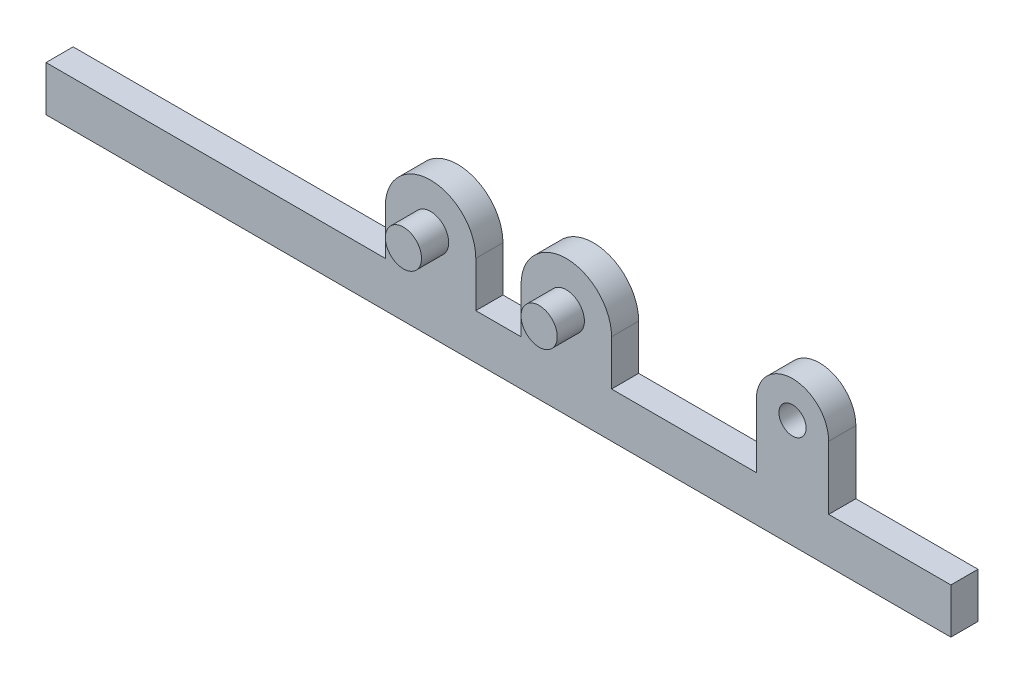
ISO-10303-21;
HEADER;
FILE_DESCRIPTION(('STEP AP214'),'2;1');
FILE_NAME('part.step','',(''),(''),'','','');
FILE_SCHEMA(('AUTOMOTIVE_DESIGN { 1 0 10303 214 1 1 1 1 }'));
ENDSEC;
DATA;
#1=APPLICATION_CONTEXT('core data for automotive mechanical design processes');
#2=APPLICATION_PROTOCOL_DEFINITION('international standard','automotive_design',2000,#1);
#3=PRODUCT_CONTEXT('',#1,'mechanical');
#4=PRODUCT('Part','Part','',(#3));
#5=PRODUCT_RELATED_PRODUCT_CATEGORY('part','',(#4));
#6=PRODUCT_DEFINITION_FORMATION('','',#4);
#7=PRODUCT_DEFINITION_CONTEXT('part definition',#1,'design');
#8=PRODUCT_DEFINITION('design','',#6,#7);
#9=PRODUCT_DEFINITION_SHAPE('','',#8);
#10=(LENGTH_UNIT() NAMED_UNIT(*) SI_UNIT(.MILLI.,.METRE.));
#11=(NAMED_UNIT(*) PLANE_ANGLE_UNIT() SI_UNIT($,.RADIAN.));
#12=(NAMED_UNIT(*) SI_UNIT($,.STERADIAN.) SOLID_ANGLE_UNIT());
#13=UNCERTAINTY_MEASURE_WITH_UNIT(LENGTH_MEASURE(1.E-05),#10,'distance_accuracy_value','');
#14=(GEOMETRIC_REPRESENTATION_CONTEXT(3) GLOBAL_UNCERTAINTY_ASSIGNED_CONTEXT((#13)) GLOBAL_UNIT_ASSIGNED_CONTEXT((#10,
#11,#12)) REPRESENTATION_CONTEXT('',''));
#15=CARTESIAN_POINT('',(0.,0.,0.));
#16=DIRECTION('',(0.,0.,1.));
#17=DIRECTION('',(1.,0.,0.));
#18=AXIS2_PLACEMENT_3D('',#15,#16,#17);
#19=CARTESIAN_POINT('',(1000.,0.,30.));
#20=DIRECTION('',(0.,-1.,0.));
#21=DIRECTION('',(0.,0.,-1.));
#22=AXIS2_PLACEMENT_3D('',#19,#20,#21);
#23=PLANE('',#22);
#24=DIRECTION('',(1.,0.,0.));
#25=VECTOR('',#24,1.);
#26=CARTESIAN_POINT('',(1000.,0.,30.));
#27=LINE('',#26,#25);
#28=CARTESIAN_POINT('',(625.,0.,30.));
#29=VERTEX_POINT('',#28);
#30=CARTESIAN_POINT('',(785.,0.,30.));
#31=VERTEX_POINT('',#30);
#32=EDGE_CURVE('E50',#29,#31,#27,.T.);
#33=ORIENTED_EDGE('',*,*,#32,.T.);
#34=DIRECTION('',(0.,0.,1.));
#35=VECTOR('',#34,1.);
#36=CARTESIAN_POINT('',(785.,0.,0.));
#37=LINE('',#36,#35);
#38=CARTESIAN_POINT('',(785.,0.,0.));
#39=VERTEX_POINT('',#38);
#40=EDGE_CURVE('E168',#39,#31,#37,.T.);
#41=ORIENTED_EDGE('',*,*,#40,.F.);
#42=DIRECTION('',(1.,0.,0.));
#43=VECTOR('',#42,1.);
#44=CARTESIAN_POINT('',(1000.,0.,0.));
#45=LINE('',#44,#43);
#46=CARTESIAN_POINT('',(625.,0.,0.));
#47=VERTEX_POINT('',#46);
#48=EDGE_CURVE('E207',#47,#39,#45,.T.);
#49=ORIENTED_EDGE('',*,*,#48,.F.);
#50=DIRECTION('',(0.,0.,-1.));
#51=VECTOR('',#50,1.);
#52=CARTESIAN_POINT('',(625.,0.,30.));
#53=LINE('',#52,#51);
#54=EDGE_CURVE('E221',#29,#47,#53,.T.);
#55=ORIENTED_EDGE('',*,*,#54,.F.);
#56=EDGE_LOOP('',(#33,#41,#49,#55));
#57=FACE_BOUND('',#56,.T.);
#58=ADVANCED_FACE('F35',(#57),#23,.F.);
#59=CARTESIAN_POINT('',(425.,50.,30.));
#60=DIRECTION('',(0.,0.,-1.));
#61=DIRECTION('',(-1.,0.,0.));
#62=AXIS2_PLACEMENT_3D('',#59,#60,#61);
#63=PLANE('',#62);
#64=CARTESIAN_POINT('',(825.,70.,30.));
#65=DIRECTION('',(0.,0.,1.));
#66=DIRECTION('',(1.,0.,0.));
#67=AXIS2_PLACEMENT_3D('',#64,#65,#66);
#68=CIRCLE('',#67,15.);
#69=CARTESIAN_POINT('',(840.,70.,30.));
#70=VERTEX_POINT('',#69);
#71=EDGE_CURVE('E437',#70,#70,#68,.T.);
#72=ORIENTED_EDGE('',*,*,#71,.F.);
#73=EDGE_LOOP('',(#72));
#74=FACE_BOUND('',#73,.T.);
#75=DIRECTION('',(0.,-1.,0.));
#76=VECTOR('',#75,1.);
#77=CARTESIAN_POINT('',(0.,0.,30.));
#78=LINE('',#77,#76);
#79=CARTESIAN_POINT('',(0.,0.,30.));
#80=VERTEX_POINT('',#79);
#81=CARTESIAN_POINT('',(0.,-50.,30.));
#82=VERTEX_POINT('',#81);
#83=EDGE_CURVE('E257',#80,#82,#78,.T.);
#84=ORIENTED_EDGE('',*,*,#83,.T.);
#85=DIRECTION('',(1.,0.,0.));
#86=VECTOR('',#85,1.);
#87=CARTESIAN_POINT('',(0.,-50.,30.));
#88=LINE('',#87,#86);
#89=CARTESIAN_POINT('',(1000.,-50.,30.));
#90=VERTEX_POINT('',#89);
#91=EDGE_CURVE('E259',#82,#90,#88,.T.);
#92=ORIENTED_EDGE('',*,*,#91,.T.);
#93=DIRECTION('',(0.,-1.,0.));
#94=VECTOR('',#93,1.);
#95=CARTESIAN_POINT('',(1000.,0.,30.));
#96=LINE('',#95,#94);
#97=CARTESIAN_POINT('',(1000.,0.,30.));
#98=VERTEX_POINT('',#97);
#99=EDGE_CURVE('E158',#98,#90,#96,.T.);
#100=ORIENTED_EDGE('',*,*,#99,.F.);
#101=CARTESIAN_POINT('',(865.,0.,30.));
#102=VERTEX_POINT('',#101);
#103=EDGE_CURVE('E149',#102,#98,#27,.T.);
#104=ORIENTED_EDGE('',*,*,#103,.F.);
#105=DIRECTION('',(0.,1.,0.));
#106=VECTOR('',#105,1.);
#107=CARTESIAN_POINT('',(865.,0.,30.));
#108=LINE('',#107,#106);
#109=CARTESIAN_POINT('',(865.,70.,30.));
#110=VERTEX_POINT('',#109);
#111=EDGE_CURVE('E155',#102,#110,#108,.T.);
#112=ORIENTED_EDGE('',*,*,#111,.T.);
#113=CARTESIAN_POINT('',(825.,70.,30.));
#114=DIRECTION('',(0.,0.,1.));
#115=DIRECTION('',(-1.,0.,0.));
#116=AXIS2_PLACEMENT_3D('',#113,#114,#115);
#117=CIRCLE('',#116,40.);
#118=CARTESIAN_POINT('',(785.,70.,30.));
#119=VERTEX_POINT('',#118);
#120=EDGE_CURVE('E171',#110,#119,#117,.T.);
#121=ORIENTED_EDGE('',*,*,#120,.T.);
#122=DIRECTION('',(0.,-1.,0.));
#123=VECTOR('',#122,1.);
#124=CARTESIAN_POINT('',(785.,0.,30.));
#125=LINE('',#124,#123);
#126=EDGE_CURVE('E172',#119,#31,#125,.T.);
#127=ORIENTED_EDGE('',*,*,#126,.T.);
#128=ORIENTED_EDGE('',*,*,#32,.F.);
#129=DIRECTION('',(0.,-1.,0.));
#130=VECTOR('',#129,1.);
#131=CARTESIAN_POINT('',(625.,0.,30.));
#132=LINE('',#131,#130);
#133=CARTESIAN_POINT('',(625.,50.,30.));
#134=VERTEX_POINT('',#133);
#135=EDGE_CURVE('E160',#134,#29,#132,.T.);
#136=ORIENTED_EDGE('',*,*,#135,.F.);
#137=CARTESIAN_POINT('',(575.,50.,30.));
#138=DIRECTION('',(0.,0.,-1.));
#139=DIRECTION('',(1.,0.,0.));
#140=AXIS2_PLACEMENT_3D('',#137,#138,#139);
#141=CIRCLE('',#140,50.);
#142=CARTESIAN_POINT('',(525.,50.,30.));
#143=VERTEX_POINT('',#142);
#144=EDGE_CURVE('E214',#143,#134,#141,.T.);
#145=ORIENTED_EDGE('',*,*,#144,.F.);
#146=DIRECTION('',(0.,1.,0.));
#147=VECTOR('',#146,1.);
#148=CARTESIAN_POINT('',(525.,0.,30.));
#149=LINE('',#148,#147);
#150=CARTESIAN_POINT('',(525.,0.,30.));
#151=VERTEX_POINT('',#150);
#152=EDGE_CURVE('E211',#151,#143,#149,.T.);
#153=ORIENTED_EDGE('',*,*,#152,.F.);
#154=DIRECTION('',(-1.,0.,0.));
#155=VECTOR('',#154,1.);
#156=CARTESIAN_POINT('',(475.,0.,30.));
#157=LINE('',#156,#155);
#158=CARTESIAN_POINT('',(475.,0.,30.));
#159=VERTEX_POINT('',#158);
#160=EDGE_CURVE('E261',#151,#159,#157,.T.);
#161=ORIENTED_EDGE('',*,*,#160,.T.);
#162=DIRECTION('',(0.,1.,0.));
#163=VECTOR('',#162,1.);
#164=CARTESIAN_POINT('',(475.,0.,30.));
#165=LINE('',#164,#163);
#166=CARTESIAN_POINT('',(475.,50.,30.));
#167=VERTEX_POINT('',#166);
#168=EDGE_CURVE('E263',#159,#167,#165,.T.);
#169=ORIENTED_EDGE('',*,*,#168,.T.);
#170=CARTESIAN_POINT('',(425.,50.,30.));
#171=DIRECTION('',(0.,0.,1.));
#172=DIRECTION('',(-1.,0.,0.));
#173=AXIS2_PLACEMENT_3D('',#170,#171,#172);
#174=CIRCLE('',#173,50.);
#175=CARTESIAN_POINT('',(375.,50.,30.));
#176=VERTEX_POINT('',#175);
#177=EDGE_CURVE('E265',#167,#176,#174,.T.);
#178=ORIENTED_EDGE('',*,*,#177,.T.);
#179=DIRECTION('',(0.,-1.,0.));
#180=VECTOR('',#179,1.);
#181=CARTESIAN_POINT('',(375.,0.,30.));
#182=LINE('',#181,#180);
#183=CARTESIAN_POINT('',(375.,0.,30.));
#184=VERTEX_POINT('',#183);
#185=EDGE_CURVE('E267',#176,#184,#182,.T.);
#186=ORIENTED_EDGE('',*,*,#185,.T.);
#187=DIRECTION('',(-1.,0.,0.));
#188=VECTOR('',#187,1.);
#189=CARTESIAN_POINT('',(0.,0.,30.));
#190=LINE('',#189,#188);
#191=EDGE_CURVE('E269',#184,#80,#190,.T.);
#192=ORIENTED_EDGE('',*,*,#191,.T.);
#193=EDGE_LOOP('',(#84,#92,#100,#104,#112,#121,#127,#128,#136,#145,#153,#161,#169,#178,#186,#192));
#194=FACE_BOUND('',#193,.T.);
#195=CARTESIAN_POINT('',(425.,50.,30.));
#196=DIRECTION('',(0.,0.,-1.));
#197=DIRECTION('',(-1.,0.,0.));
#198=AXIS2_PLACEMENT_3D('',#195,#196,#197);
#199=CIRCLE('',#198,20.);
#200=CARTESIAN_POINT('',(405.,50.,30.));
#201=VERTEX_POINT('',#200);
#202=EDGE_CURVE('E11',#201,#201,#199,.F.);
#203=ORIENTED_EDGE('',*,*,#202,.F.);
#204=EDGE_LOOP('',(#203));
#205=FACE_BOUND('',#204,.T.);
#206=CARTESIAN_POINT('',(575.,50.,30.));
#207=DIRECTION('',(0.,0.,1.));
#208=DIRECTION('',(1.,0.,0.));
#209=AXIS2_PLACEMENT_3D('',#206,#207,#208);
#210=CIRCLE('',#209,20.);
#211=CARTESIAN_POINT('',(595.,50.,30.));
#212=VERTEX_POINT('',#211);
#213=EDGE_CURVE('E236',#212,#212,#210,.F.);
#214=ORIENTED_EDGE('',*,*,#213,.T.);
#215=EDGE_LOOP('',(#214));
#216=FACE_BOUND('',#215,.T.);
#217=ADVANCED_FACE('F151',(#74,#194,#205,#216),#63,.F.);
#218=CARTESIAN_POINT('',(0.,0.,30.));
#219=DIRECTION('',(1.,0.,0.));
#220=DIRECTION('',(0.,0.,-1.));
#221=AXIS2_PLACEMENT_3D('',#218,#219,#220);
#222=PLANE('',#221);
#223=DIRECTION('',(0.,-1.,0.));
#224=VECTOR('',#223,1.);
#225=CARTESIAN_POINT('',(0.,0.,0.));
#226=LINE('',#225,#224);
#227=CARTESIAN_POINT('',(0.,0.,0.));
#228=VERTEX_POINT('',#227);
#229=CARTESIAN_POINT('',(0.,-50.,0.));
#230=VERTEX_POINT('',#229);
#231=EDGE_CURVE('E242',#228,#230,#226,.T.);
#232=ORIENTED_EDGE('',*,*,#231,.T.);
#233=DIRECTION('',(0.,0.,-1.));
#234=VECTOR('',#233,1.);
#235=CARTESIAN_POINT('',(0.,-50.,30.));
#236=LINE('',#235,#234);
#237=EDGE_CURVE('E43',#82,#230,#236,.T.);
#238=ORIENTED_EDGE('',*,*,#237,.F.);
#239=ORIENTED_EDGE('',*,*,#83,.F.);
#240=DIRECTION('',(0.,0.,-1.));
#241=VECTOR('',#240,1.);
#242=CARTESIAN_POINT('',(0.,0.,30.));
#243=LINE('',#242,#241);
#244=EDGE_CURVE('E271',#80,#228,#243,.T.);
#245=ORIENTED_EDGE('',*,*,#244,.T.);
#246=EDGE_LOOP('',(#232,#238,#239,#245));
#247=FACE_BOUND('',#246,.T.);
#248=ADVANCED_FACE('F37',(#247),#222,.F.);
#249=CARTESIAN_POINT('',(0.,-50.,30.));
#250=DIRECTION('',(0.,1.,0.));
#251=DIRECTION('',(-1.,0.,0.));
#252=AXIS2_PLACEMENT_3D('',#249,#250,#251);
#253=PLANE('',#252);
#254=DIRECTION('',(1.,0.,0.));
#255=VECTOR('',#254,1.);
#256=CARTESIAN_POINT('',(0.,-50.,0.));
#257=LINE('',#256,#255);
#258=CARTESIAN_POINT('',(1000.,-50.,0.));
#259=VERTEX_POINT('',#258);
#260=EDGE_CURVE('E245',#230,#259,#257,.T.);
#261=ORIENTED_EDGE('',*,*,#260,.T.);
#262=DIRECTION('',(0.,0.,-1.));
#263=VECTOR('',#262,1.);
#264=CARTESIAN_POINT('',(1000.,-50.,30.));
#265=LINE('',#264,#263);
#266=EDGE_CURVE('E233',#90,#259,#265,.T.);
#267=ORIENTED_EDGE('',*,*,#266,.F.);
#268=ORIENTED_EDGE('',*,*,#91,.F.);
#269=ORIENTED_EDGE('',*,*,#237,.T.);
#270=EDGE_LOOP('',(#261,#267,#268,#269));
#271=FACE_BOUND('',#270,.T.);
#272=ADVANCED_FACE('F288',(#271),#253,.F.);
#273=CARTESIAN_POINT('',(475.,0.,30.));
#274=DIRECTION('',(0.,-1.,0.));
#275=DIRECTION('',(0.,0.,-1.));
#276=AXIS2_PLACEMENT_3D('',#273,#274,#275);
#277=PLANE('',#276);
#278=DIRECTION('',(-1.,0.,0.));
#279=VECTOR('',#278,1.);
#280=CARTESIAN_POINT('',(475.,0.,0.));
#281=LINE('',#280,#279);
#282=CARTESIAN_POINT('',(525.,0.,0.));
#283=VERTEX_POINT('',#282);
#284=CARTESIAN_POINT('',(475.,0.,0.));
#285=VERTEX_POINT('',#284);
#286=EDGE_CURVE('E247',#283,#285,#281,.T.);
#287=ORIENTED_EDGE('',*,*,#286,.T.);
#288=DIRECTION('',(0.,0.,-1.));
#289=VECTOR('',#288,1.);
#290=CARTESIAN_POINT('',(475.,0.,30.));
#291=LINE('',#290,#289);
#292=EDGE_CURVE('E283',#159,#285,#291,.T.);
#293=ORIENTED_EDGE('',*,*,#292,.F.);
#294=ORIENTED_EDGE('',*,*,#160,.F.);
#295=DIRECTION('',(0.,0.,-1.));
#296=VECTOR('',#295,1.);
#297=CARTESIAN_POINT('',(525.,0.,30.));
#298=LINE('',#297,#296);
#299=EDGE_CURVE('E230',#151,#283,#298,.T.);
#300=ORIENTED_EDGE('',*,*,#299,.T.);
#301=EDGE_LOOP('',(#287,#293,#294,#300));
#302=FACE_BOUND('',#301,.T.);
#303=ADVANCED_FACE('F346',(#302),#277,.F.);
#304=CARTESIAN_POINT('',(475.,0.,30.));
#305=DIRECTION('',(-1.,0.,0.));
#306=DIRECTION('',(0.,0.,1.));
#307=AXIS2_PLACEMENT_3D('',#304,#305,#306);
#308=PLANE('',#307);
#309=DIRECTION('',(0.,1.,0.));
#310=VECTOR('',#309,1.);
#311=CARTESIAN_POINT('',(475.,0.,0.));
#312=LINE('',#311,#310);
#313=CARTESIAN_POINT('',(475.,50.,0.));
#314=VERTEX_POINT('',#313);
#315=EDGE_CURVE('E249',#285,#314,#312,.T.);
#316=ORIENTED_EDGE('',*,*,#315,.T.);
#317=DIRECTION('',(0.,0.,-1.));
#318=VECTOR('',#317,1.);
#319=CARTESIAN_POINT('',(475.,50.,30.));
#320=LINE('',#319,#318);
#321=EDGE_CURVE('E280',#167,#314,#320,.T.);
#322=ORIENTED_EDGE('',*,*,#321,.F.);
#323=ORIENTED_EDGE('',*,*,#168,.F.);
#324=ORIENTED_EDGE('',*,*,#292,.T.);
#325=EDGE_LOOP('',(#316,#322,#323,#324));
#326=FACE_BOUND('',#325,.T.);
#327=ADVANCED_FACE('F467',(#326),#308,.F.);
#328=CARTESIAN_POINT('',(425.,50.,30.));
#329=DIRECTION('',(0.,0.,-1.));
#330=DIRECTION('',(-1.,0.,0.));
#331=AXIS2_PLACEMENT_3D('',#328,#329,#330);
#332=CYLINDRICAL_SURFACE('',#331,50.);
#333=CARTESIAN_POINT('',(425.,50.,0.));
#334=DIRECTION('',(0.,0.,1.));
#335=DIRECTION('',(-1.,0.,0.));
#336=AXIS2_PLACEMENT_3D('',#333,#334,#335);
#337=CIRCLE('',#336,50.);
#338=CARTESIAN_POINT('',(375.,50.,0.));
#339=VERTEX_POINT('',#338);
#340=EDGE_CURVE('E251',#314,#339,#337,.T.);
#341=ORIENTED_EDGE('',*,*,#340,.T.);
#342=DIRECTION('',(0.,0.,-1.));
#343=VECTOR('',#342,1.);
#344=CARTESIAN_POINT('',(375.,50.,30.));
#345=LINE('',#344,#343);
#346=EDGE_CURVE('E277',#176,#339,#345,.T.);
#347=ORIENTED_EDGE('',*,*,#346,.F.);
#348=ORIENTED_EDGE('',*,*,#177,.F.);
#349=ORIENTED_EDGE('',*,*,#321,.T.);
#350=EDGE_LOOP('',(#341,#347,#348,#349));
#351=FACE_BOUND('',#350,.T.);
#352=ADVANCED_FACE('F507',(#351),#332,.T.);
#353=CARTESIAN_POINT('',(375.,0.,30.));
#354=DIRECTION('',(1.,0.,0.));
#355=DIRECTION('',(0.,0.,-1.));
#356=AXIS2_PLACEMENT_3D('',#353,#354,#355);
#357=PLANE('',#356);
#358=DIRECTION('',(0.,-1.,0.));
#359=VECTOR('',#358,1.);
#360=CARTESIAN_POINT('',(375.,0.,0.));
#361=LINE('',#360,#359);
#362=CARTESIAN_POINT('',(375.,0.,0.));
#363=VERTEX_POINT('',#362);
#364=EDGE_CURVE('E253',#339,#363,#361,.T.);
#365=ORIENTED_EDGE('',*,*,#364,.T.);
#366=DIRECTION('',(0.,0.,-1.));
#367=VECTOR('',#366,1.);
#368=CARTESIAN_POINT('',(375.,0.,30.));
#369=LINE('',#368,#367);
#370=EDGE_CURVE('E274',#184,#363,#369,.T.);
#371=ORIENTED_EDGE('',*,*,#370,.F.);
#372=ORIENTED_EDGE('',*,*,#185,.F.);
#373=ORIENTED_EDGE('',*,*,#346,.T.);
#374=EDGE_LOOP('',(#365,#371,#372,#373));
#375=FACE_BOUND('',#374,.T.);
#376=ADVANCED_FACE('F514',(#375),#357,.F.);
#377=CARTESIAN_POINT('',(0.,0.,30.));
#378=DIRECTION('',(0.,-1.,0.));
#379=DIRECTION('',(0.,0.,-1.));
#380=AXIS2_PLACEMENT_3D('',#377,#378,#379);
#381=PLANE('',#380);
#382=DIRECTION('',(-1.,0.,0.));
#383=VECTOR('',#382,1.);
#384=CARTESIAN_POINT('',(0.,0.,0.));
#385=LINE('',#384,#383);
#386=EDGE_CURVE('E255',#363,#228,#385,.T.);
#387=ORIENTED_EDGE('',*,*,#386,.T.);
#388=ORIENTED_EDGE('',*,*,#244,.F.);
#389=ORIENTED_EDGE('',*,*,#191,.F.);
#390=ORIENTED_EDGE('',*,*,#370,.T.);
#391=EDGE_LOOP('',(#387,#388,#389,#390));
#392=FACE_BOUND('',#391,.T.);
#393=ADVANCED_FACE('F414',(#392),#381,.F.);
#394=CARTESIAN_POINT('',(425.,50.,0.));
#395=DIRECTION('',(0.,0.,-1.));
#396=DIRECTION('',(-1.,0.,0.));
#397=AXIS2_PLACEMENT_3D('',#394,#395,#396);
#398=PLANE('',#397);
#399=CARTESIAN_POINT('',(825.,70.,0.));
#400=DIRECTION('',(0.,0.,1.));
#401=DIRECTION('',(1.,0.,0.));
#402=AXIS2_PLACEMENT_3D('',#399,#400,#401);
#403=CIRCLE('',#402,15.);
#404=CARTESIAN_POINT('',(840.,70.,0.));
#405=VERTEX_POINT('',#404);
#406=EDGE_CURVE('E177',#405,#405,#403,.T.);
#407=ORIENTED_EDGE('',*,*,#406,.T.);
#408=EDGE_LOOP('',(#407));
#409=FACE_BOUND('',#408,.T.);
#410=ORIENTED_EDGE('',*,*,#231,.F.);
#411=ORIENTED_EDGE('',*,*,#386,.F.);
#412=ORIENTED_EDGE('',*,*,#364,.F.);
#413=ORIENTED_EDGE('',*,*,#340,.F.);
#414=ORIENTED_EDGE('',*,*,#315,.F.);
#415=ORIENTED_EDGE('',*,*,#286,.F.);
#416=DIRECTION('',(0.,1.,0.));
#417=VECTOR('',#416,1.);
#418=CARTESIAN_POINT('',(525.,0.,0.));
#419=LINE('',#418,#417);
#420=CARTESIAN_POINT('',(525.,50.,0.));
#421=VERTEX_POINT('',#420);
#422=EDGE_CURVE('E198',#283,#421,#419,.T.);
#423=ORIENTED_EDGE('',*,*,#422,.T.);
#424=CARTESIAN_POINT('',(575.,50.,0.));
#425=DIRECTION('',(0.,0.,-1.));
#426=DIRECTION('',(1.,0.,0.));
#427=AXIS2_PLACEMENT_3D('',#424,#425,#426);
#428=CIRCLE('',#427,50.);
#429=CARTESIAN_POINT('',(625.,50.,0.));
#430=VERTEX_POINT('',#429);
#431=EDGE_CURVE('E201',#421,#430,#428,.T.);
#432=ORIENTED_EDGE('',*,*,#431,.T.);
#433=DIRECTION('',(0.,-1.,0.));
#434=VECTOR('',#433,1.);
#435=CARTESIAN_POINT('',(625.,0.,0.));
#436=LINE('',#435,#434);
#437=EDGE_CURVE('E204',#430,#47,#436,.T.);
#438=ORIENTED_EDGE('',*,*,#437,.T.);
#439=ORIENTED_EDGE('',*,*,#48,.T.);
#440=DIRECTION('',(0.,-1.,0.));
#441=VECTOR('',#440,1.);
#442=CARTESIAN_POINT('',(785.,0.,0.));
#443=LINE('',#442,#441);
#444=CARTESIAN_POINT('',(785.,70.,0.));
#445=VERTEX_POINT('',#444);
#446=EDGE_CURVE('E174',#445,#39,#443,.T.);
#447=ORIENTED_EDGE('',*,*,#446,.F.);
#448=CARTESIAN_POINT('',(825.,70.,0.));
#449=DIRECTION('',(0.,0.,1.));
#450=DIRECTION('',(-1.,0.,0.));
#451=AXIS2_PLACEMENT_3D('',#448,#449,#450);
#452=CIRCLE('',#451,40.);
#453=CARTESIAN_POINT('',(865.,70.,0.));
#454=VERTEX_POINT('',#453);
#455=EDGE_CURVE('E185',#454,#445,#452,.T.);
#456=ORIENTED_EDGE('',*,*,#455,.F.);
#457=DIRECTION('',(0.,1.,0.));
#458=VECTOR('',#457,1.);
#459=CARTESIAN_POINT('',(865.,0.,0.));
#460=LINE('',#459,#458);
#461=CARTESIAN_POINT('',(865.,0.,0.));
#462=VERTEX_POINT('',#461);
#463=EDGE_CURVE('E183',#462,#454,#460,.T.);
#464=ORIENTED_EDGE('',*,*,#463,.F.);
#465=CARTESIAN_POINT('',(1000.,0.,0.));
#466=VERTEX_POINT('',#465);
#467=EDGE_CURVE('E58',#462,#466,#45,.T.);
#468=ORIENTED_EDGE('',*,*,#467,.T.);
#469=DIRECTION('',(0.,-1.,0.));
#470=VECTOR('',#469,1.);
#471=CARTESIAN_POINT('',(1000.,0.,0.));
#472=LINE('',#471,#470);
#473=EDGE_CURVE('E195',#466,#259,#472,.T.);
#474=ORIENTED_EDGE('',*,*,#473,.T.);
#475=ORIENTED_EDGE('',*,*,#260,.F.);
#476=EDGE_LOOP('',(#410,#411,#412,#413,#414,#415,#423,#432,#438,#439,#447,#456,#464,#468,#474,#475));
#477=FACE_BOUND('',#476,.T.);
#478=ADVANCED_FACE('F296',(#409,#477),#398,.T.);
#479=CARTESIAN_POINT('',(425.,50.,60.));
#480=DIRECTION('',(0.,0.,-1.));
#481=DIRECTION('',(-1.,0.,0.));
#482=AXIS2_PLACEMENT_3D('',#479,#480,#481);
#483=CYLINDRICAL_SURFACE('',#482,20.);
#484=CARTESIAN_POINT('',(425.,50.,60.));
#485=DIRECTION('',(0.,0.,1.));
#486=DIRECTION('',(1.,0.,0.));
#487=AXIS2_PLACEMENT_3D('',#484,#485,#486);
#488=CIRCLE('',#487,20.);
#489=CARTESIAN_POINT('',(445.,50.,60.));
#490=VERTEX_POINT('',#489);
#491=EDGE_CURVE('E239',#490,#490,#488,.T.);
#492=ORIENTED_EDGE('',*,*,#491,.F.);
#493=EDGE_LOOP('',(#492));
#494=FACE_BOUND('',#493,.T.);
#495=ORIENTED_EDGE('',*,*,#202,.T.);
#496=EDGE_LOOP('',(#495));
#497=FACE_BOUND('',#496,.T.);
#498=ADVANCED_FACE('F312',(#494,#497),#483,.T.);
#499=CARTESIAN_POINT('',(425.,50.,60.));
#500=DIRECTION('',(0.,0.,1.));
#501=DIRECTION('',(1.,0.,0.));
#502=AXIS2_PLACEMENT_3D('',#499,#500,#501);
#503=PLANE('',#502);
#504=ORIENTED_EDGE('',*,*,#491,.T.);
#505=EDGE_LOOP('',(#504));
#506=FACE_BOUND('',#505,.T.);
#507=ADVANCED_FACE('F303',(#506),#503,.T.);
#508=CARTESIAN_POINT('',(1000.,0.,30.));
#509=DIRECTION('',(-1.,0.,0.));
#510=DIRECTION('',(0.,0.,-1.));
#511=AXIS2_PLACEMENT_3D('',#508,#509,#510);
#512=PLANE('',#511);
#513=ORIENTED_EDGE('',*,*,#473,.F.);
#514=DIRECTION('',(0.,0.,-1.));
#515=VECTOR('',#514,1.);
#516=CARTESIAN_POINT('',(1000.,0.,30.));
#517=LINE('',#516,#515);
#518=EDGE_CURVE('E219',#98,#466,#517,.T.);
#519=ORIENTED_EDGE('',*,*,#518,.F.);
#520=ORIENTED_EDGE('',*,*,#99,.T.);
#521=ORIENTED_EDGE('',*,*,#266,.T.);
#522=EDGE_LOOP('',(#513,#519,#520,#521));
#523=FACE_BOUND('',#522,.T.);
#524=ADVANCED_FACE('F300',(#523),#512,.F.);
#525=CARTESIAN_POINT('',(525.,0.,30.));
#526=DIRECTION('',(1.,0.,0.));
#527=DIRECTION('',(0.,0.,1.));
#528=AXIS2_PLACEMENT_3D('',#525,#526,#527);
#529=PLANE('',#528);
#530=ORIENTED_EDGE('',*,*,#422,.F.);
#531=ORIENTED_EDGE('',*,*,#299,.F.);
#532=ORIENTED_EDGE('',*,*,#152,.T.);
#533=DIRECTION('',(0.,0.,-1.));
#534=VECTOR('',#533,1.);
#535=CARTESIAN_POINT('',(525.,50.,30.));
#536=LINE('',#535,#534);
#537=EDGE_CURVE('E227',#143,#421,#536,.T.);
#538=ORIENTED_EDGE('',*,*,#537,.T.);
#539=EDGE_LOOP('',(#530,#531,#532,#538));
#540=FACE_BOUND('',#539,.T.);
#541=ADVANCED_FACE('F302',(#540),#529,.F.);
#542=CARTESIAN_POINT('',(575.,50.,30.));
#543=DIRECTION('',(0.,0.,-1.));
#544=DIRECTION('',(1.,0.,0.));
#545=AXIS2_PLACEMENT_3D('',#542,#543,#544);
#546=CYLINDRICAL_SURFACE('',#545,50.);
#547=ORIENTED_EDGE('',*,*,#431,.F.);
#548=ORIENTED_EDGE('',*,*,#537,.F.);
#549=ORIENTED_EDGE('',*,*,#144,.T.);
#550=DIRECTION('',(0.,0.,-1.));
#551=VECTOR('',#550,1.);
#552=CARTESIAN_POINT('',(625.,50.,30.));
#553=LINE('',#552,#551);
#554=EDGE_CURVE('E224',#134,#430,#553,.T.);
#555=ORIENTED_EDGE('',*,*,#554,.T.);
#556=EDGE_LOOP('',(#547,#548,#549,#555));
#557=FACE_BOUND('',#556,.T.);
#558=ADVANCED_FACE('F309',(#557),#546,.T.);
#559=CARTESIAN_POINT('',(625.,0.,30.));
#560=DIRECTION('',(-1.,0.,0.));
#561=DIRECTION('',(0.,0.,-1.));
#562=AXIS2_PLACEMENT_3D('',#559,#560,#561);
#563=PLANE('',#562);
#564=ORIENTED_EDGE('',*,*,#437,.F.);
#565=ORIENTED_EDGE('',*,*,#554,.F.);
#566=ORIENTED_EDGE('',*,*,#135,.T.);
#567=ORIENTED_EDGE('',*,*,#54,.T.);
#568=EDGE_LOOP('',(#564,#565,#566,#567));
#569=FACE_BOUND('',#568,.T.);
#570=ADVANCED_FACE('F326',(#569),#563,.F.);
#571=ORIENTED_EDGE('',*,*,#467,.F.);
#572=DIRECTION('',(0.,0.,1.));
#573=VECTOR('',#572,1.);
#574=CARTESIAN_POINT('',(865.,0.,0.));
#575=LINE('',#574,#573);
#576=EDGE_CURVE('E162',#462,#102,#575,.T.);
#577=ORIENTED_EDGE('',*,*,#576,.T.);
#578=ORIENTED_EDGE('',*,*,#103,.T.);
#579=ORIENTED_EDGE('',*,*,#518,.T.);
#580=EDGE_LOOP('',(#571,#577,#578,#579));
#581=FACE_BOUND('',#580,.T.);
#582=ADVANCED_FACE('F163',(#581),#23,.F.);
#583=CARTESIAN_POINT('',(575.,50.,60.));
#584=DIRECTION('',(0.,0.,-1.));
#585=DIRECTION('',(1.,0.,0.));
#586=AXIS2_PLACEMENT_3D('',#583,#584,#585);
#587=CYLINDRICAL_SURFACE('',#586,20.);
#588=CARTESIAN_POINT('',(575.,50.,60.));
#589=DIRECTION('',(0.,0.,-1.));
#590=DIRECTION('',(-1.,0.,0.));
#591=AXIS2_PLACEMENT_3D('',#588,#589,#590);
#592=CIRCLE('',#591,20.);
#593=CARTESIAN_POINT('',(555.,50.,60.));
#594=VERTEX_POINT('',#593);
#595=EDGE_CURVE('E190',#594,#594,#592,.T.);
#596=ORIENTED_EDGE('',*,*,#595,.T.);
#597=EDGE_LOOP('',(#596));
#598=FACE_BOUND('',#597,.T.);
#599=ORIENTED_EDGE('',*,*,#213,.F.);
#600=EDGE_LOOP('',(#599));
#601=FACE_BOUND('',#600,.T.);
#602=ADVANCED_FACE('F325',(#598,#601),#587,.T.);
#603=CARTESIAN_POINT('',(575.,50.,60.));
#604=DIRECTION('',(0.,0.,1.));
#605=DIRECTION('',(-1.,0.,0.));
#606=AXIS2_PLACEMENT_3D('',#603,#604,#605);
#607=PLANE('',#606);
#608=ORIENTED_EDGE('',*,*,#595,.F.);
#609=EDGE_LOOP('',(#608));
#610=FACE_BOUND('',#609,.T.);
#611=ADVANCED_FACE('F331',(#610),#607,.T.);
#612=CARTESIAN_POINT('',(785.,0.,0.));
#613=DIRECTION('',(-1.,0.,0.));
#614=DIRECTION('',(0.,0.,1.));
#615=AXIS2_PLACEMENT_3D('',#612,#613,#614);
#616=PLANE('',#615);
#617=ORIENTED_EDGE('',*,*,#126,.F.);
#618=DIRECTION('',(0.,0.,1.));
#619=VECTOR('',#618,1.);
#620=CARTESIAN_POINT('',(785.,70.,0.));
#621=LINE('',#620,#619);
#622=EDGE_CURVE('E188',#445,#119,#621,.T.);
#623=ORIENTED_EDGE('',*,*,#622,.F.);
#624=ORIENTED_EDGE('',*,*,#446,.T.);
#625=ORIENTED_EDGE('',*,*,#40,.T.);
#626=EDGE_LOOP('',(#617,#623,#624,#625));
#627=FACE_BOUND('',#626,.T.);
#628=ADVANCED_FACE('F352',(#627),#616,.T.);
#629=CARTESIAN_POINT('',(825.,70.,0.));
#630=DIRECTION('',(0.,0.,1.));
#631=DIRECTION('',(1.,0.,0.));
#632=AXIS2_PLACEMENT_3D('',#629,#630,#631);
#633=CYLINDRICAL_SURFACE('',#632,40.);
#634=ORIENTED_EDGE('',*,*,#120,.F.);
#635=DIRECTION('',(0.,0.,1.));
#636=VECTOR('',#635,1.);
#637=CARTESIAN_POINT('',(865.,70.,0.));
#638=LINE('',#637,#636);
#639=EDGE_CURVE('E167',#454,#110,#638,.T.);
#640=ORIENTED_EDGE('',*,*,#639,.F.);
#641=ORIENTED_EDGE('',*,*,#455,.T.);
#642=ORIENTED_EDGE('',*,*,#622,.T.);
#643=EDGE_LOOP('',(#634,#640,#641,#642));
#644=FACE_BOUND('',#643,.T.);
#645=ADVANCED_FACE('F356',(#644),#633,.T.);
#646=CARTESIAN_POINT('',(865.,0.,0.));
#647=DIRECTION('',(1.,0.,0.));
#648=DIRECTION('',(0.,0.,-1.));
#649=AXIS2_PLACEMENT_3D('',#646,#647,#648);
#650=PLANE('',#649);
#651=ORIENTED_EDGE('',*,*,#111,.F.);
#652=ORIENTED_EDGE('',*,*,#576,.F.);
#653=ORIENTED_EDGE('',*,*,#463,.T.);
#654=ORIENTED_EDGE('',*,*,#639,.T.);
#655=EDGE_LOOP('',(#651,#652,#653,#654));
#656=FACE_BOUND('',#655,.T.);
#657=ADVANCED_FACE('F170',(#656),#650,.T.);
#658=CARTESIAN_POINT('',(825.,70.,0.));
#659=DIRECTION('',(0.,0.,1.));
#660=DIRECTION('',(1.,0.,0.));
#661=AXIS2_PLACEMENT_3D('',#658,#659,#660);
#662=CYLINDRICAL_SURFACE('',#661,15.);
#663=ORIENTED_EDGE('',*,*,#406,.F.);
#664=EDGE_LOOP('',(#663));
#665=FACE_BOUND('',#664,.T.);
#666=ORIENTED_EDGE('',*,*,#71,.T.);
#667=EDGE_LOOP('',(#666));
#668=FACE_BOUND('',#667,.T.);
#669=ADVANCED_FACE('F363',(#665,#668),#662,.F.);
#670=CLOSED_SHELL('',(#58,#217,#248,#272,#303,#327,#352,#376,#393,#478,#498,#507,#524,#541,#558,
#570,#582,#602,#611,#628,#645,#657,#669));
#671=MANIFOLD_SOLID_BREP('B2',#670);
#672=ADVANCED_BREP_SHAPE_REPRESENTATION('',(#18,#671),#14);
#673=SHAPE_DEFINITION_REPRESENTATION(#9,#672);
ENDSEC;
END-ISO-10303-21;
